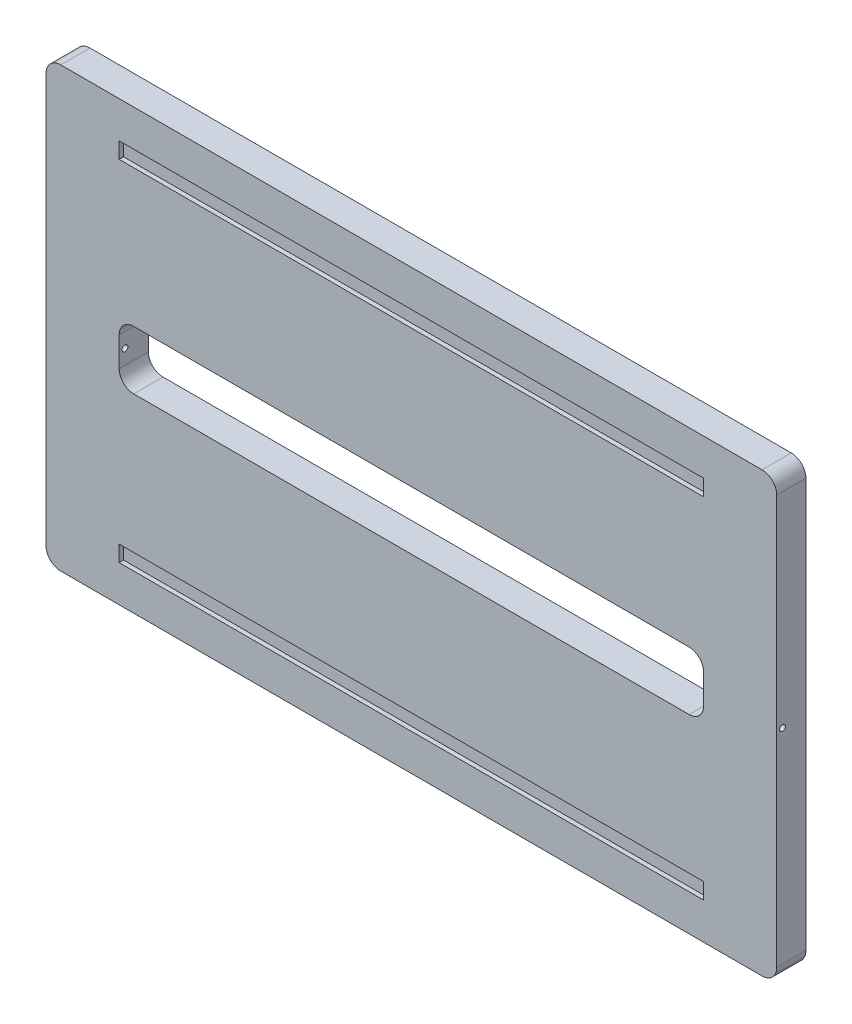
from build123d import *

# Parameters (mm, degrees)
ESQUISSE1_W             = 500
ESQUISSE1_H             = 300
BOSS_EXTRU_1_DEPTH      = 20
ESQUISSE2_W             = 11
ESQUISSE2_H             = 11
ENL_V_MAT_EXTRU_1_DEPTH = 450
ESQUISSE3_W             = 50
ESQUISSE3_H             = 11
BOSS_EXTRU_2_DEPTH      = 3
ESQUISSE4_W             = 11
ESQUISSE4_H             = 11
ENL_V_MAT_EXTRU_2_DEPTH = 450
ESQUISSE5_W             = 50
ESQUISSE5_H             = 11
BOSS_EXTRU_3_DEPTH      = 3
CONG_1_R                = 10
ESQUISSE6_W             = 400
ESQUISSE6_H             = 40
ENL_V_MAT_EXTRU_3_DEPTH = 584.438085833
CONG_2_R                = 10
ESQUISSE7_R             = 2
ENL_V_MAT_EXTRU_4_DEPTH = 584.438085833


with BuildPart() as part:
    # Esquisse1 → Boss.-Extru.1 (new body)
    with BuildSketch(Plane.XY):
        with Locations((250, 150)):
            Rectangle(ESQUISSE1_W, ESQUISSE1_H)
    extrude(amount=BOSS_EXTRU_1_DEPTH)

    # Esquisse2 → Enl_v. mat.-Extru.1 (cut)
    with BuildSketch(Plane(origin=(500, 0, 0), x_dir=(0, 0, -1), z_dir=(1, 0, 0))):
        with Locations((-22.5, 30.5)):
            Rectangle(ESQUISSE2_W, ESQUISSE2_H)
    extrude(amount=-ENL_V_MAT_EXTRU_1_DEPTH, mode=Mode.SUBTRACT)

    # Esquisse3 → Boss.-Extru.2 (add)
    with BuildSketch(Plane.XY.offset(17)):
        with Locations((475, 30.5)):
            Rectangle(ESQUISSE3_W, ESQUISSE3_H)
    extrude(amount=BOSS_EXTRU_2_DEPTH)

    # Esquisse4 → Enl_v. mat.-Extru.2 (cut)
    with BuildSketch(Plane(origin=(500, 0, 0), x_dir=(0, 0, -1), z_dir=(1, 0, 0))):
        with Locations((-22.5, 269.5)):
            Rectangle(ESQUISSE4_W, ESQUISSE4_H)
    extrude(amount=-ENL_V_MAT_EXTRU_2_DEPTH, mode=Mode.SUBTRACT)

    # Esquisse5 → Boss.-Extru.3 (add)
    with BuildSketch(Plane.XY.offset(17)):
        with Locations((475, 269.5)):
            Rectangle(ESQUISSE5_W, ESQUISSE5_H)
    extrude(amount=BOSS_EXTRU_3_DEPTH)

    # Cong_1
    cong_1_edges = [part.edges().sort_by_distance(p)[0] for p in [
        (0, 300, 10),
        (500, 300, 10),
        (500, 0, 10),
        (0, 0, 10),
    ]]
    fillet(cong_1_edges, radius=CONG_1_R)

    # Esquisse6 → Enl_v. mat.-Extru.3 (cut, through all)
    with BuildSketch(Plane.XY.offset(20)):
        with Locations((250, 150)):
            Rectangle(ESQUISSE6_W, ESQUISSE6_H)
    extrude(amount=-ENL_V_MAT_EXTRU_3_DEPTH, mode=Mode.SUBTRACT)

    # Cong_2
    cong_2_edges = [part.edges().sort_by_distance(p)[0] for p in [
        (50, 130, 10),
        (50, 170, 10),
        (450, 170, 10),
        (450, 130, 10),
    ]]
    fillet(cong_2_edges, radius=CONG_2_R)

    # Esquisse7 → Enl_v. mat.-Extru.4 (cut, through all)
    with BuildSketch(Plane(origin=(500, 0, 0), x_dir=(0, 0, -1), z_dir=(1, 0, 0))):
        with Locations((-16, 150)):
            Circle(ESQUISSE7_R)
    extrude(amount=-ENL_V_MAT_EXTRU_4_DEPTH, mode=Mode.SUBTRACT)


solid = part.part
